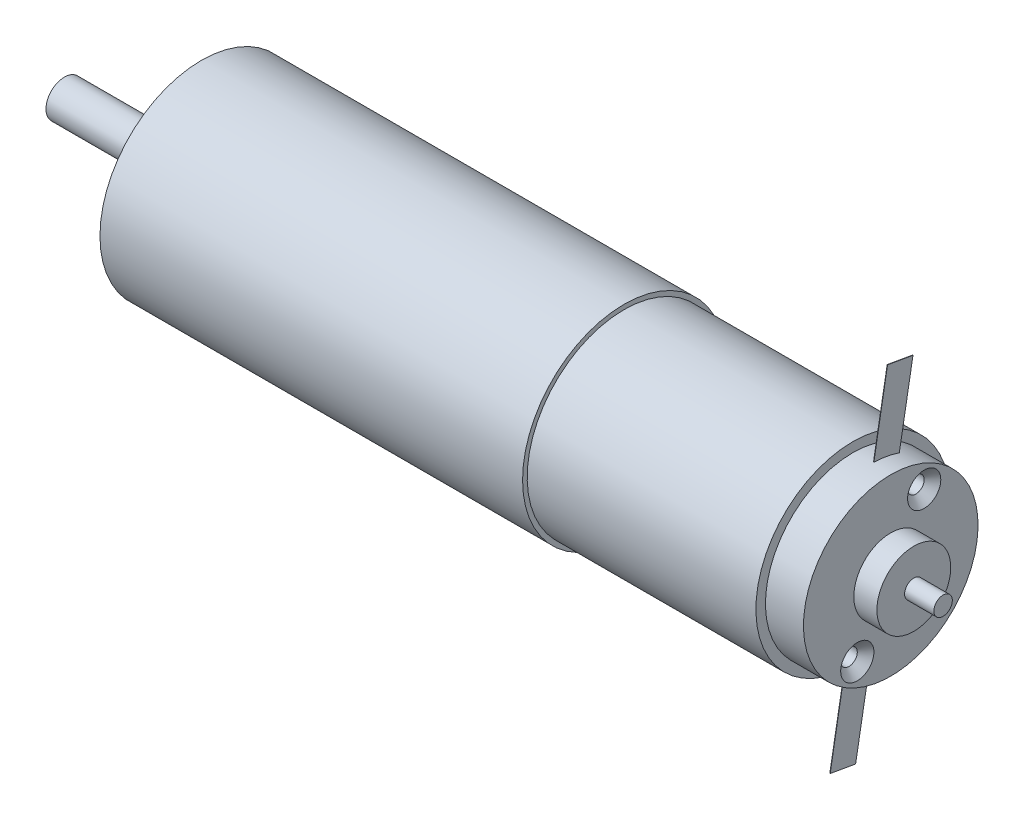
from build123d import *

# Parameters (mm, degrees)
CUT_EXTRUDE2_DEPTH                              = 63.613277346
CUT_EXTRUDE2_DEPTH_BACK                         = 63.613277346
SKETCH6_W                                       = 12.637138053
SKETCH6_H                                       = 3.681214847
EXTRUDE1_START                                  = 2
EXTRUDE1_DEPTH                                  = 0.04
M2_5X0_45_TAPPED_HOLE1_D                        = 2.05
M2_5X0_45_TAPPED_HOLE1_DEPTH                    = 5.35
M2_5X0_45_TAPPED_HOLE1_TIP                      = 0.615882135
CSK_FOR_M1_6_COUNTERSUNK_FLAT_HEAD1_D           = 1.8
CSK_FOR_M1_6_COUNTERSUNK_FLAT_HEAD1_DEPTH       = 4.35
CSK_FOR_M1_6_COUNTERSUNK_FLAT_HEAD1_CSINK_D     = 3.6
CSK_FOR_M1_6_COUNTERSUNK_FLAT_HEAD1_CSINK_ANGLE = 90
CSK_FOR_M1_6_COUNTERSUNK_FLAT_HEAD1_TIP         = 0.540774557
CUT_EXTRUDE3_DEPTH                              = 65.177886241
CUT_EXTRUDE3_DEPTH_BACK                         = 65.177886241
SKETCH9_W                                       = 10.325
SKETCH9_H                                       = 2


with BuildPart() as part:
    # Sketch1 → Revolve1 (revolve)
    with BuildSketch(Plane.XY, mode=Mode.PRIVATE) as revolve1_sk:
        Polygon((0, -10.5), (24.7852, -10.5), (24.7852, -9.4615), (28.9, -9.4615), (28.9, -4), (31.4, -4), (31.4, -1), (44.9, -1), (44.9, 0), (-60.65, 0), (-60.65, -2), (-48.95, -2), (-48.95, -3.4925), (-47.15, -3.4925), (-47.15, -5), (-45.8, -5), (-45.8, -11), (0, -11), align=None)
    revolve(revolve1_sk.sketch.rotate(Axis((44.9, 0, 0), (-1, 0, 0)), 180), axis=Axis((44.9, 0, 0), (-1, 0, 0)))

    # Sketch6 → Cut-Extrude2 (cut, two sides: drawn at the far end of the back side and taken through both)
    with BuildSketch(Plane(origin=(0, 0, 0), x_dir=(1, 0, 0), z_dir=(0, 1, 0)).offset(-CUT_EXTRUDE2_DEPTH_BACK)):
        with Locations((-57.668569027, 3.340607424)):
            Rectangle(SKETCH6_W, SKETCH6_H)
    extrude(amount=CUT_EXTRUDE2_DEPTH + CUT_EXTRUDE2_DEPTH_BACK, mode=Mode.SUBTRACT)

    # Sketch2 → Extrude1 (add)
    with BuildSketch(Plane(origin=(24.7852, 0, 0), x_dir=(0, 0, -1), z_dir=(1, 0, 0)).offset(EXTRUDE1_START)):
        Polygon((1.729571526, 17.871166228), (-0.452413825, 5.496512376), (2.305047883, 5.010297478), (4.487033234, 17.38495133), align=None)
        Polygon((-4.487033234, -17.38495133), (-1.729571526, -17.871166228), (0.452413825, -5.496512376), (-2.305047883, -5.010297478), align=None)
    extrude(amount=EXTRUDE1_DEPTH)

    # M2.5x0.45 Tapped Hole1
    with Locations(Plane.ZY.offset(45.8)):
        with Locations((0, 7), (6.062177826, -3.5), (-6.062177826, -3.5)):
            Hole(M2_5X0_45_TAPPED_HOLE1_D / 2, depth=M2_5X0_45_TAPPED_HOLE1_DEPTH)
            with Locations((0, 0, -(M2_5X0_45_TAPPED_HOLE1_DEPTH + M2_5X0_45_TAPPED_HOLE1_TIP / 2))):  # 118° drill point
                Cone(0, M2_5X0_45_TAPPED_HOLE1_D / 2, M2_5X0_45_TAPPED_HOLE1_TIP, mode=Mode.SUBTRACT)

    # CSK for M1.6 Countersunk Flat Head1
    with Locations(Plane(origin=(28.9, 0, 0), x_dir=(0, 0, -1), z_dir=(1, 0, 0))):
        with Locations((3.625, 6.278684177), (-3.625, -6.278684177)):
            CounterSinkHole(CSK_FOR_M1_6_COUNTERSUNK_FLAT_HEAD1_D / 2, CSK_FOR_M1_6_COUNTERSUNK_FLAT_HEAD1_CSINK_D / 2, depth=CSK_FOR_M1_6_COUNTERSUNK_FLAT_HEAD1_DEPTH, counter_sink_angle=CSK_FOR_M1_6_COUNTERSUNK_FLAT_HEAD1_CSINK_ANGLE)
            with Locations((0, 0, -(CSK_FOR_M1_6_COUNTERSUNK_FLAT_HEAD1_DEPTH + CSK_FOR_M1_6_COUNTERSUNK_FLAT_HEAD1_TIP / 2))):  # 118° drill point
                Cone(0, CSK_FOR_M1_6_COUNTERSUNK_FLAT_HEAD1_D / 2, CSK_FOR_M1_6_COUNTERSUNK_FLAT_HEAD1_TIP, mode=Mode.SUBTRACT)

    # Sketch9 → Cut-Extrude3 (cut, two sides: drawn at the far end of the back side and taken through both)
    with BuildSketch(Plane.XY.offset(-CUT_EXTRUDE3_DEPTH_BACK)):
        with Locations((39.7375, 0)):
            Rectangle(SKETCH9_W, SKETCH9_H)
    extrude(amount=CUT_EXTRUDE3_DEPTH + CUT_EXTRUDE3_DEPTH_BACK, mode=Mode.SUBTRACT)


solid = part.part
